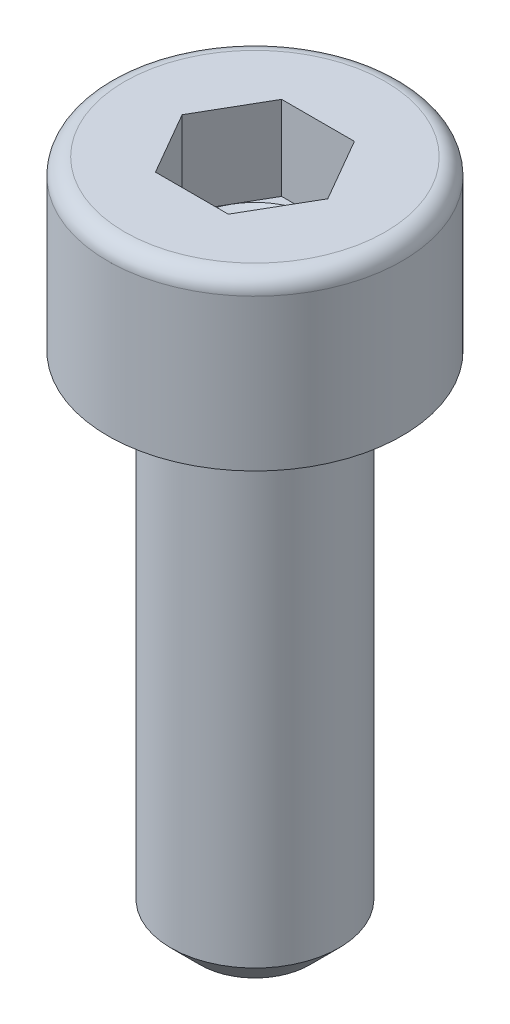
ISO-10303-21;
HEADER;
FILE_DESCRIPTION(('STEP AP214'),'2;1');
FILE_NAME('part.step','',(''),(''),'','','');
FILE_SCHEMA(('AUTOMOTIVE_DESIGN { 1 0 10303 214 1 1 1 1 }'));
ENDSEC;
DATA;
#1=APPLICATION_CONTEXT('core data for automotive mechanical design processes');
#2=APPLICATION_PROTOCOL_DEFINITION('international standard','automotive_design',2000,#1);
#3=PRODUCT_CONTEXT('',#1,'mechanical');
#4=PRODUCT('Part','Part','',(#3));
#5=PRODUCT_RELATED_PRODUCT_CATEGORY('part','',(#4));
#6=PRODUCT_DEFINITION_FORMATION('','',#4);
#7=PRODUCT_DEFINITION_CONTEXT('part definition',#1,'design');
#8=PRODUCT_DEFINITION('design','',#6,#7);
#9=PRODUCT_DEFINITION_SHAPE('','',#8);
#10=(LENGTH_UNIT() NAMED_UNIT(*) SI_UNIT(.MILLI.,.METRE.));
#11=(NAMED_UNIT(*) PLANE_ANGLE_UNIT() SI_UNIT($,.RADIAN.));
#12=(NAMED_UNIT(*) SI_UNIT($,.STERADIAN.) SOLID_ANGLE_UNIT());
#13=UNCERTAINTY_MEASURE_WITH_UNIT(LENGTH_MEASURE(1.E-05),#10,'distance_accuracy_value','');
#14=(GEOMETRIC_REPRESENTATION_CONTEXT(3) GLOBAL_UNCERTAINTY_ASSIGNED_CONTEXT((#13)) GLOBAL_UNIT_ASSIGNED_CONTEXT((#10,
#11,#12)) REPRESENTATION_CONTEXT('',''));
#15=CARTESIAN_POINT('',(0.,0.,0.));
#16=DIRECTION('',(0.,0.,1.));
#17=DIRECTION('',(1.,0.,0.));
#18=AXIS2_PLACEMENT_3D('',#15,#16,#17);
#19=CARTESIAN_POINT('',(-2.59807621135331,2.,1.5));
#20=DIRECTION('',(0.,-1.,0.));
#21=DIRECTION('',(0.,0.,-1.));
#22=AXIS2_PLACEMENT_3D('',#19,#20,#21);
#23=PLANE('',#22);
#24=DIRECTION('',(-0.499999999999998,0.,-0.86602540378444));
#25=VECTOR('',#24,1.);
#26=CARTESIAN_POINT('',(-0.866025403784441,2.,1.5));
#27=LINE('',#26,#25);
#28=CARTESIAN_POINT('',(-1.29903810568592,2.00000000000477,0.750000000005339));
#29=VERTEX_POINT('',#28);
#30=CARTESIAN_POINT('',(-1.73205080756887,2.,0.));
#31=VERTEX_POINT('',#30);
#32=EDGE_CURVE('E116',#29,#31,#27,.T.);
#33=ORIENTED_EDGE('',*,*,#32,.F.);
#34=CARTESIAN_POINT('',(0.,2.00000000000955,0.));
#35=DIRECTION('',(0.,1.,0.));
#36=DIRECTION('',(0.,0.,1.));
#37=AXIS2_PLACEMENT_3D('',#34,#35,#36);
#38=CIRCLE('',#37,1.50000000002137);
#39=CARTESIAN_POINT('',(-1.29903810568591,2.00000000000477,-0.75000000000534));
#40=VERTEX_POINT('',#39);
#41=EDGE_CURVE('E91',#29,#40,#38,.F.);
#42=ORIENTED_EDGE('',*,*,#41,.T.);
#43=DIRECTION('',(0.499999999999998,0.,-0.86602540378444));
#44=VECTOR('',#43,1.);
#45=CARTESIAN_POINT('',(-0.866025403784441,2.,-1.5));
#46=LINE('',#45,#44);
#47=EDGE_CURVE('E117',#31,#40,#46,.T.);
#48=ORIENTED_EDGE('',*,*,#47,.F.);
#49=EDGE_LOOP('',(#33,#42,#48));
#50=FACE_BOUND('',#49,.T.);
#51=ADVANCED_FACE('F16',(#50),#23,.F.);
#52=CARTESIAN_POINT('',(-2.59807621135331,2.,1.5));
#53=DIRECTION('',(0.,-1.,0.));
#54=DIRECTION('',(0.,0.,-1.));
#55=AXIS2_PLACEMENT_3D('',#52,#53,#54);
#56=PLANE('',#55);
#57=DIRECTION('',(-1.,0.,0.));
#58=VECTOR('',#57,1.);
#59=CARTESIAN_POINT('',(0.86602540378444,2.,1.5));
#60=LINE('',#59,#58);
#61=CARTESIAN_POINT('',(0.,2.00000000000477,1.50000000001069));
#62=VERTEX_POINT('',#61);
#63=CARTESIAN_POINT('',(-0.866025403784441,2.,1.5));
#64=VERTEX_POINT('',#63);
#65=EDGE_CURVE('E112',#62,#64,#60,.T.);
#66=ORIENTED_EDGE('',*,*,#65,.F.);
#67=CARTESIAN_POINT('',(0.,2.00000000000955,0.));
#68=DIRECTION('',(0.,1.,0.));
#69=DIRECTION('',(0.,0.,1.));
#70=AXIS2_PLACEMENT_3D('',#67,#68,#69);
#71=CIRCLE('',#70,1.50000000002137);
#72=EDGE_CURVE('E95',#29,#62,#71,.T.);
#73=ORIENTED_EDGE('',*,*,#72,.F.);
#74=DIRECTION('',(-0.499999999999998,0.,-0.86602540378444));
#75=VECTOR('',#74,1.);
#76=CARTESIAN_POINT('',(-0.866025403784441,2.,1.5));
#77=LINE('',#76,#75);
#78=EDGE_CURVE('E109',#64,#29,#77,.T.);
#79=ORIENTED_EDGE('',*,*,#78,.F.);
#80=EDGE_LOOP('',(#66,#73,#79));
#81=FACE_BOUND('',#80,.T.);
#82=ADVANCED_FACE('F107',(#81),#56,.F.);
#83=CARTESIAN_POINT('',(-0.866025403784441,2.,1.5));
#84=DIRECTION('',(0.86602540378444,0.,-0.499999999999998));
#85=DIRECTION('',(-0.499999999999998,0.,-0.86602540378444));
#86=AXIS2_PLACEMENT_3D('',#83,#84,#85);
#87=PLANE('',#86);
#88=ORIENTED_EDGE('',*,*,#32,.T.);
#89=DIRECTION('',(0.,1.,0.));
#90=VECTOR('',#89,1.);
#91=CARTESIAN_POINT('',(-1.73205080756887,2.,0.));
#92=LINE('',#91,#90);
#93=CARTESIAN_POINT('',(-1.73205080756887,4.,0.));
#94=VERTEX_POINT('',#93);
#95=EDGE_CURVE('E136',#94,#31,#92,.F.);
#96=ORIENTED_EDGE('',*,*,#95,.F.);
#97=DIRECTION('',(-0.499999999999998,0.,-0.86602540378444));
#98=VECTOR('',#97,1.);
#99=CARTESIAN_POINT('',(-0.866025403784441,4.,1.5));
#100=LINE('',#99,#98);
#101=CARTESIAN_POINT('',(-0.866025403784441,4.,1.5));
#102=VERTEX_POINT('',#101);
#103=EDGE_CURVE('E114',#94,#102,#100,.F.);
#104=ORIENTED_EDGE('',*,*,#103,.T.);
#105=DIRECTION('',(0.,1.,0.));
#106=VECTOR('',#105,1.);
#107=CARTESIAN_POINT('',(-0.866025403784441,2.,1.5));
#108=LINE('',#107,#106);
#109=EDGE_CURVE('E126',#64,#102,#108,.T.);
#110=ORIENTED_EDGE('',*,*,#109,.F.);
#111=ORIENTED_EDGE('',*,*,#78,.T.);
#112=EDGE_LOOP('',(#88,#96,#104,#110,#111));
#113=FACE_BOUND('',#112,.T.);
#114=ADVANCED_FACE('F123',(#113),#87,.T.);
#115=CARTESIAN_POINT('',(-0.866025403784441,2.,-1.5));
#116=DIRECTION('',(0.86602540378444,0.,0.499999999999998));
#117=DIRECTION('',(0.499999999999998,0.,-0.86602540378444));
#118=AXIS2_PLACEMENT_3D('',#115,#116,#117);
#119=PLANE('',#118);
#120=DIRECTION('',(0.499999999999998,0.,-0.86602540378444));
#121=VECTOR('',#120,1.);
#122=CARTESIAN_POINT('',(-1.29903810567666,2.,-0.749999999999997));
#123=LINE('',#122,#121);
#124=CARTESIAN_POINT('',(-0.866025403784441,2.,-1.5));
#125=VERTEX_POINT('',#124);
#126=EDGE_CURVE('E103',#40,#125,#123,.T.);
#127=ORIENTED_EDGE('',*,*,#126,.T.);
#128=DIRECTION('',(0.,1.,0.));
#129=VECTOR('',#128,1.);
#130=CARTESIAN_POINT('',(-0.866025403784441,2.,-1.5));
#131=LINE('',#130,#129);
#132=CARTESIAN_POINT('',(-0.866025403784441,4.,-1.5));
#133=VERTEX_POINT('',#132);
#134=EDGE_CURVE('E245',#133,#125,#131,.F.);
#135=ORIENTED_EDGE('',*,*,#134,.F.);
#136=DIRECTION('',(0.499999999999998,0.,-0.86602540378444));
#137=VECTOR('',#136,1.);
#138=CARTESIAN_POINT('',(-0.866025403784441,4.,-1.5));
#139=LINE('',#138,#137);
#140=EDGE_CURVE('E121',#133,#94,#139,.F.);
#141=ORIENTED_EDGE('',*,*,#140,.T.);
#142=ORIENTED_EDGE('',*,*,#95,.T.);
#143=ORIENTED_EDGE('',*,*,#47,.T.);
#144=EDGE_LOOP('',(#127,#135,#141,#142,#143));
#145=FACE_BOUND('',#144,.T.);
#146=ADVANCED_FACE('F405',(#145),#119,.T.);
#147=CARTESIAN_POINT('',(-2.59807621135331,2.,1.5));
#148=DIRECTION('',(0.,-1.,0.));
#149=DIRECTION('',(0.,0.,-1.));
#150=AXIS2_PLACEMENT_3D('',#147,#148,#149);
#151=PLANE('',#150);
#152=ORIENTED_EDGE('',*,*,#126,.F.);
#153=CARTESIAN_POINT('',(0.,2.00000000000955,0.));
#154=DIRECTION('',(0.,1.,0.));
#155=DIRECTION('',(0.,0.,1.));
#156=AXIS2_PLACEMENT_3D('',#153,#154,#155);
#157=CIRCLE('',#156,1.50000000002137);
#158=CARTESIAN_POINT('',(0.,2.00000000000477,-1.50000000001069));
#159=VERTEX_POINT('',#158);
#160=EDGE_CURVE('E98',#40,#159,#157,.F.);
#161=ORIENTED_EDGE('',*,*,#160,.T.);
#162=DIRECTION('',(1.,0.,0.));
#163=VECTOR('',#162,1.);
#164=CARTESIAN_POINT('',(0.866025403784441,2.,-1.5));
#165=LINE('',#164,#163);
#166=EDGE_CURVE('E163',#125,#159,#165,.T.);
#167=ORIENTED_EDGE('',*,*,#166,.F.);
#168=EDGE_LOOP('',(#152,#161,#167));
#169=FACE_BOUND('',#168,.T.);
#170=ADVANCED_FACE('F397',(#169),#151,.F.);
#171=CARTESIAN_POINT('',(0.,2.00000000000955,0.));
#172=DIRECTION('',(0.,1.,0.));
#173=DIRECTION('',(0.,0.,1.));
#174=AXIS2_PLACEMENT_3D('',#171,#172,#173);
#175=CONICAL_SURFACE('',#174,1.50000000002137,1.0471975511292);
#176=CARTESIAN_POINT('',(-4.2632564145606E-11,1.13397459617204,0.));
#177=VERTEX_POINT('',#176);
#178=VERTEX_LOOP('',#177);
#179=FACE_BOUND('',#178,.T.);
#180=CARTESIAN_POINT('',(0.,2.00000000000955,0.));
#181=DIRECTION('',(0.,1.,0.));
#182=DIRECTION('',(0.,0.,1.));
#183=AXIS2_PLACEMENT_3D('',#180,#181,#182);
#184=CIRCLE('',#183,1.50000000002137);
#185=CARTESIAN_POINT('',(1.29903810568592,2.00000000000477,0.750000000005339));
#186=VERTEX_POINT('',#185);
#187=EDGE_CURVE('E150',#62,#186,#184,.T.);
#188=ORIENTED_EDGE('',*,*,#187,.T.);
#189=CARTESIAN_POINT('',(0.,2.00000000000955,0.));
#190=DIRECTION('',(0.,1.,0.));
#191=DIRECTION('',(0.,0.,1.));
#192=AXIS2_PLACEMENT_3D('',#189,#190,#191);
#193=CIRCLE('',#192,1.50000000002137);
#194=CARTESIAN_POINT('',(1.29903810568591,2.00000000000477,-0.75000000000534));
#195=VERTEX_POINT('',#194);
#196=EDGE_CURVE('E165',#195,#186,#193,.F.);
#197=ORIENTED_EDGE('',*,*,#196,.F.);
#198=CARTESIAN_POINT('',(0.,2.00000000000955,0.));
#199=DIRECTION('',(0.,1.,0.));
#200=DIRECTION('',(0.,0.,1.));
#201=AXIS2_PLACEMENT_3D('',#198,#199,#200);
#202=CIRCLE('',#201,1.50000000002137);
#203=EDGE_CURVE('E160',#195,#159,#202,.T.);
#204=ORIENTED_EDGE('',*,*,#203,.T.);
#205=ORIENTED_EDGE('',*,*,#160,.F.);
#206=ORIENTED_EDGE('',*,*,#41,.F.);
#207=ORIENTED_EDGE('',*,*,#72,.T.);
#208=EDGE_LOOP('',(#188,#197,#204,#205,#206,#207));
#209=FACE_BOUND('',#208,.T.);
#210=ADVANCED_FACE('F94',(#179,#209),#175,.F.);
#211=CARTESIAN_POINT('',(-2.59807621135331,2.,1.5));
#212=DIRECTION('',(0.,-1.,0.));
#213=DIRECTION('',(0.,0.,-1.));
#214=AXIS2_PLACEMENT_3D('',#211,#212,#213);
#215=PLANE('',#214);
#216=DIRECTION('',(-0.499999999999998,0.,0.86602540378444));
#217=VECTOR('',#216,1.);
#218=CARTESIAN_POINT('',(0.86602540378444,2.,1.5));
#219=LINE('',#218,#217);
#220=CARTESIAN_POINT('',(0.866025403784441,2.,1.5));
#221=VERTEX_POINT('',#220);
#222=EDGE_CURVE('E233',#186,#221,#219,.T.);
#223=ORIENTED_EDGE('',*,*,#222,.F.);
#224=ORIENTED_EDGE('',*,*,#187,.F.);
#225=DIRECTION('',(-1.,0.,0.));
#226=VECTOR('',#225,1.);
#227=CARTESIAN_POINT('',(0.86602540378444,2.,1.5));
#228=LINE('',#227,#226);
#229=EDGE_CURVE('E149',#221,#62,#228,.T.);
#230=ORIENTED_EDGE('',*,*,#229,.F.);
#231=EDGE_LOOP('',(#223,#224,#230));
#232=FACE_BOUND('',#231,.T.);
#233=ADVANCED_FACE('F282',(#232),#215,.F.);
#234=CARTESIAN_POINT('',(0.86602540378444,2.,1.5));
#235=DIRECTION('',(0.,0.,-1.));
#236=DIRECTION('',(-1.,0.,0.));
#237=AXIS2_PLACEMENT_3D('',#234,#235,#236);
#238=PLANE('',#237);
#239=ORIENTED_EDGE('',*,*,#65,.T.);
#240=ORIENTED_EDGE('',*,*,#109,.T.);
#241=DIRECTION('',(-1.,0.,0.));
#242=VECTOR('',#241,1.);
#243=CARTESIAN_POINT('',(0.86602540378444,4.,1.5));
#244=LINE('',#243,#242);
#245=CARTESIAN_POINT('',(0.86602540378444,4.,1.5));
#246=VERTEX_POINT('',#245);
#247=EDGE_CURVE('E146',#102,#246,#244,.F.);
#248=ORIENTED_EDGE('',*,*,#247,.T.);
#249=DIRECTION('',(0.,1.,0.));
#250=VECTOR('',#249,1.);
#251=CARTESIAN_POINT('',(0.86602540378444,2.,1.5));
#252=LINE('',#251,#250);
#253=EDGE_CURVE('E239',#221,#246,#252,.T.);
#254=ORIENTED_EDGE('',*,*,#253,.F.);
#255=ORIENTED_EDGE('',*,*,#229,.T.);
#256=EDGE_LOOP('',(#239,#240,#248,#254,#255));
#257=FACE_BOUND('',#256,.T.);
#258=ADVANCED_FACE('F278',(#257),#238,.T.);
#259=CARTESIAN_POINT('',(0.866025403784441,2.,-1.5));
#260=DIRECTION('',(0.,0.,1.));
#261=DIRECTION('',(1.,0.,0.));
#262=AXIS2_PLACEMENT_3D('',#259,#260,#261);
#263=PLANE('',#262);
#264=DIRECTION('',(1.,0.,0.));
#265=VECTOR('',#264,1.);
#266=CARTESIAN_POINT('',(-2.59807621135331,2.,-1.5));
#267=LINE('',#266,#265);
#268=CARTESIAN_POINT('',(0.86602540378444,2.,-1.5));
#269=VERTEX_POINT('',#268);
#270=EDGE_CURVE('E162',#159,#269,#267,.T.);
#271=ORIENTED_EDGE('',*,*,#270,.T.);
#272=DIRECTION('',(0.,1.,0.));
#273=VECTOR('',#272,1.);
#274=CARTESIAN_POINT('',(0.866025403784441,2.,-1.5));
#275=LINE('',#274,#273);
#276=CARTESIAN_POINT('',(0.86602540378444,4.,-1.5));
#277=VERTEX_POINT('',#276);
#278=EDGE_CURVE('E218',#277,#269,#275,.F.);
#279=ORIENTED_EDGE('',*,*,#278,.F.);
#280=DIRECTION('',(1.,0.,0.));
#281=VECTOR('',#280,1.);
#282=CARTESIAN_POINT('',(0.866025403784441,4.,-1.5));
#283=LINE('',#282,#281);
#284=EDGE_CURVE('E242',#277,#133,#283,.F.);
#285=ORIENTED_EDGE('',*,*,#284,.T.);
#286=ORIENTED_EDGE('',*,*,#134,.T.);
#287=ORIENTED_EDGE('',*,*,#166,.T.);
#288=EDGE_LOOP('',(#271,#279,#285,#286,#287));
#289=FACE_BOUND('',#288,.T.);
#290=ADVANCED_FACE('F299',(#289),#263,.T.);
#291=CARTESIAN_POINT('',(-2.59807621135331,2.,1.5));
#292=DIRECTION('',(0.,-1.,0.));
#293=DIRECTION('',(0.,0.,-1.));
#294=AXIS2_PLACEMENT_3D('',#291,#292,#293);
#295=PLANE('',#294);
#296=ORIENTED_EDGE('',*,*,#270,.F.);
#297=ORIENTED_EDGE('',*,*,#203,.F.);
#298=DIRECTION('',(0.499999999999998,0.,0.86602540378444));
#299=VECTOR('',#298,1.);
#300=CARTESIAN_POINT('',(0.866025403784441,2.,-1.5));
#301=LINE('',#300,#299);
#302=EDGE_CURVE('E209',#269,#195,#301,.T.);
#303=ORIENTED_EDGE('',*,*,#302,.F.);
#304=EDGE_LOOP('',(#296,#297,#303));
#305=FACE_BOUND('',#304,.T.);
#306=ADVANCED_FACE('F303',(#305),#295,.F.);
#307=CARTESIAN_POINT('',(-2.59807621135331,2.,1.5));
#308=DIRECTION('',(0.,-1.,0.));
#309=DIRECTION('',(0.,0.,-1.));
#310=AXIS2_PLACEMENT_3D('',#307,#308,#309);
#311=PLANE('',#310);
#312=DIRECTION('',(0.499999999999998,0.,0.86602540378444));
#313=VECTOR('',#312,1.);
#314=CARTESIAN_POINT('',(0.866025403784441,2.,-1.5));
#315=LINE('',#314,#313);
#316=CARTESIAN_POINT('',(1.73205080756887,2.,0.));
#317=VERTEX_POINT('',#316);
#318=EDGE_CURVE('E217',#195,#317,#315,.T.);
#319=ORIENTED_EDGE('',*,*,#318,.F.);
#320=ORIENTED_EDGE('',*,*,#196,.T.);
#321=DIRECTION('',(-0.499999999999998,0.,0.86602540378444));
#322=VECTOR('',#321,1.);
#323=CARTESIAN_POINT('',(0.86602540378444,2.,1.5));
#324=LINE('',#323,#322);
#325=EDGE_CURVE('E230',#317,#186,#324,.T.);
#326=ORIENTED_EDGE('',*,*,#325,.F.);
#327=EDGE_LOOP('',(#319,#320,#326));
#328=FACE_BOUND('',#327,.T.);
#329=ADVANCED_FACE('F304',(#328),#311,.F.);
#330=CARTESIAN_POINT('',(0.86602540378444,2.,1.5));
#331=DIRECTION('',(-0.86602540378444,0.,-0.499999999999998));
#332=DIRECTION('',(-0.499999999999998,0.,0.86602540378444));
#333=AXIS2_PLACEMENT_3D('',#330,#331,#332);
#334=PLANE('',#333);
#335=ORIENTED_EDGE('',*,*,#222,.T.);
#336=ORIENTED_EDGE('',*,*,#253,.T.);
#337=DIRECTION('',(-0.499999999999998,0.,0.86602540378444));
#338=VECTOR('',#337,1.);
#339=CARTESIAN_POINT('',(0.86602540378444,4.,1.5));
#340=LINE('',#339,#338);
#341=CARTESIAN_POINT('',(1.73205080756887,4.,0.));
#342=VERTEX_POINT('',#341);
#343=EDGE_CURVE('E234',#246,#342,#340,.F.);
#344=ORIENTED_EDGE('',*,*,#343,.T.);
#345=DIRECTION('',(0.,1.,0.));
#346=VECTOR('',#345,1.);
#347=CARTESIAN_POINT('',(1.73205080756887,2.,0.));
#348=LINE('',#347,#346);
#349=EDGE_CURVE('E223',#317,#342,#348,.T.);
#350=ORIENTED_EDGE('',*,*,#349,.F.);
#351=ORIENTED_EDGE('',*,*,#325,.T.);
#352=EDGE_LOOP('',(#335,#336,#344,#350,#351));
#353=FACE_BOUND('',#352,.T.);
#354=ADVANCED_FACE('F293',(#353),#334,.T.);
#355=CARTESIAN_POINT('',(0.866025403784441,2.,-1.5));
#356=DIRECTION('',(-0.86602540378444,0.,0.499999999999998));
#357=DIRECTION('',(0.499999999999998,0.,0.86602540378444));
#358=AXIS2_PLACEMENT_3D('',#355,#356,#357);
#359=PLANE('',#358);
#360=ORIENTED_EDGE('',*,*,#318,.T.);
#361=ORIENTED_EDGE('',*,*,#349,.T.);
#362=DIRECTION('',(-0.499999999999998,0.,-0.86602540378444));
#363=VECTOR('',#362,1.);
#364=CARTESIAN_POINT('',(1.73205080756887,4.,0.));
#365=LINE('',#364,#363);
#366=EDGE_CURVE('E173',#342,#277,#365,.T.);
#367=ORIENTED_EDGE('',*,*,#366,.T.);
#368=ORIENTED_EDGE('',*,*,#278,.T.);
#369=ORIENTED_EDGE('',*,*,#302,.T.);
#370=EDGE_LOOP('',(#360,#361,#367,#368,#369));
#371=FACE_BOUND('',#370,.T.);
#372=ADVANCED_FACE('F194',(#371),#359,.T.);
#373=CARTESIAN_POINT('',(1.5,4.,0.));
#374=DIRECTION('',(0.,-1.,0.));
#375=DIRECTION('',(1.,0.,0.));
#376=AXIS2_PLACEMENT_3D('',#373,#374,#375);
#377=PLANE('',#376);
#378=ORIENTED_EDGE('',*,*,#343,.F.);
#379=ORIENTED_EDGE('',*,*,#247,.F.);
#380=ORIENTED_EDGE('',*,*,#103,.F.);
#381=ORIENTED_EDGE('',*,*,#140,.F.);
#382=ORIENTED_EDGE('',*,*,#284,.F.);
#383=ORIENTED_EDGE('',*,*,#366,.F.);
#384=EDGE_LOOP('',(#378,#379,#380,#381,#382,#383));
#385=FACE_BOUND('',#384,.T.);
#386=CARTESIAN_POINT('',(0.,4.,0.));
#387=DIRECTION('',(0.,-1.,0.));
#388=DIRECTION('',(-1.,0.,0.));
#389=AXIS2_PLACEMENT_3D('',#386,#387,#388);
#390=CIRCLE('',#389,3.1);
#391=CARTESIAN_POINT('',(-3.1,4.,0.));
#392=VERTEX_POINT('',#391);
#393=CARTESIAN_POINT('',(3.1,4.,0.));
#394=VERTEX_POINT('',#393);
#395=EDGE_CURVE('E36',#392,#394,#390,.T.);
#396=ORIENTED_EDGE('',*,*,#395,.F.);
#397=CARTESIAN_POINT('',(0.,4.,0.));
#398=DIRECTION('',(0.,-1.,0.));
#399=DIRECTION('',(1.,0.,0.));
#400=AXIS2_PLACEMENT_3D('',#397,#398,#399);
#401=CIRCLE('',#400,3.1);
#402=EDGE_CURVE('E171',#394,#392,#401,.T.);
#403=ORIENTED_EDGE('',*,*,#402,.F.);
#404=EDGE_LOOP('',(#396,#403));
#405=FACE_BOUND('',#404,.T.);
#406=ADVANCED_FACE('F175',(#385,#405),#377,.F.);
#407=CARTESIAN_POINT('',(0.,3.6,0.));
#408=DIRECTION('',(0.,1.,0.));
#409=DIRECTION('',(-1.,0.,0.));
#410=AXIS2_PLACEMENT_3D('',#407,#408,#409);
#411=TOROIDAL_SURFACE('',#410,3.1,0.4);
#412=ORIENTED_EDGE('',*,*,#395,.T.);
#413=ORIENTED_EDGE('',*,*,#402,.T.);
#414=EDGE_LOOP('',(#412,#413));
#415=FACE_BOUND('',#414,.T.);
#416=CARTESIAN_POINT('',(0.,3.6,0.));
#417=DIRECTION('',(0.,1.,0.));
#418=DIRECTION('',(-1.,0.,0.));
#419=AXIS2_PLACEMENT_3D('',#416,#417,#418);
#420=CIRCLE('',#419,3.5);
#421=CARTESIAN_POINT('',(-3.5,3.6,0.));
#422=VERTEX_POINT('',#421);
#423=EDGE_CURVE('E159',#422,#422,#420,.F.);
#424=ORIENTED_EDGE('',*,*,#423,.F.);
#425=EDGE_LOOP('',(#424));
#426=FACE_BOUND('',#425,.T.);
#427=ADVANCED_FACE('F169',(#415,#426),#411,.T.);
#428=CARTESIAN_POINT('',(0.,-12.,0.));
#429=DIRECTION('',(0.,1.,0.));
#430=DIRECTION('',(0.,0.,1.));
#431=AXIS2_PLACEMENT_3D('',#428,#429,#430);
#432=PLANE('',#431);
#433=CARTESIAN_POINT('',(0.,-11.9999999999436,0.));
#434=DIRECTION('',(0.,1.,0.));
#435=DIRECTION('',(0.,0.,1.));
#436=AXIS2_PLACEMENT_3D('',#433,#434,#435);
#437=CIRCLE('',#436,1.30000000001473);
#438=CARTESIAN_POINT('',(0.,-11.9999999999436,1.30000000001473));
#439=VERTEX_POINT('',#438);
#440=EDGE_CURVE('E156',#439,#439,#437,.T.);
#441=ORIENTED_EDGE('',*,*,#440,.F.);
#442=EDGE_LOOP('',(#441));
#443=FACE_BOUND('',#442,.T.);
#444=ADVANCED_FACE('F201',(#443),#432,.F.);
#445=CARTESIAN_POINT('',(0.,4.,0.));
#446=DIRECTION('',(0.,1.,0.));
#447=DIRECTION('',(-1.,0.,0.));
#448=AXIS2_PLACEMENT_3D('',#445,#446,#447);
#449=CYLINDRICAL_SURFACE('',#448,3.5);
#450=ORIENTED_EDGE('',*,*,#423,.T.);
#451=EDGE_LOOP('',(#450));
#452=FACE_BOUND('',#451,.T.);
#453=CARTESIAN_POINT('',(0.,0.,0.));
#454=DIRECTION('',(0.,1.,0.));
#455=DIRECTION('',(-1.,0.,0.));
#456=AXIS2_PLACEMENT_3D('',#453,#454,#455);
#457=CIRCLE('',#456,3.5);
#458=CARTESIAN_POINT('',(-3.5,0.,0.));
#459=VERTEX_POINT('',#458);
#460=EDGE_CURVE('E153',#459,#459,#457,.T.);
#461=ORIENTED_EDGE('',*,*,#460,.T.);
#462=EDGE_LOOP('',(#461));
#463=FACE_BOUND('',#462,.T.);
#464=ADVANCED_FACE('F330',(#452,#463),#449,.T.);
#465=CARTESIAN_POINT('',(0.,-11.3000000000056,0.));
#466=DIRECTION('',(0.,1.,0.));
#467=DIRECTION('',(0.,0.,1.));
#468=AXIS2_PLACEMENT_3D('',#465,#466,#467);
#469=CONICAL_SURFACE('',#468,1.99999999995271,0.785398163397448);
#470=ORIENTED_EDGE('',*,*,#440,.T.);
#471=EDGE_LOOP('',(#470));
#472=FACE_BOUND('',#471,.T.);
#473=CARTESIAN_POINT('',(0.,-11.3,0.));
#474=DIRECTION('',(0.,1.,0.));
#475=DIRECTION('',(0.,0.,1.));
#476=AXIS2_PLACEMENT_3D('',#473,#474,#475);
#477=CIRCLE('',#476,2.);
#478=CARTESIAN_POINT('',(0.,-11.3,2.));
#479=VERTEX_POINT('',#478);
#480=EDGE_CURVE('E28',#479,#479,#477,.T.);
#481=ORIENTED_EDGE('',*,*,#480,.F.);
#482=EDGE_LOOP('',(#481));
#483=FACE_BOUND('',#482,.T.);
#484=ADVANCED_FACE('F319',(#472,#483),#469,.T.);
#485=CARTESIAN_POINT('',(0.,0.,0.));
#486=DIRECTION('',(0.,1.,0.));
#487=DIRECTION('',(-1.,0.,0.));
#488=AXIS2_PLACEMENT_3D('',#485,#486,#487);
#489=PLANE('',#488);
#490=ORIENTED_EDGE('',*,*,#460,.F.);
#491=EDGE_LOOP('',(#490));
#492=FACE_BOUND('',#491,.T.);
#493=CARTESIAN_POINT('',(0.,0.,0.));
#494=DIRECTION('',(0.,1.,0.));
#495=DIRECTION('',(0.,0.,1.));
#496=AXIS2_PLACEMENT_3D('',#493,#494,#495);
#497=CIRCLE('',#496,2.);
#498=CARTESIAN_POINT('',(0.,0.,2.));
#499=VERTEX_POINT('',#498);
#500=EDGE_CURVE('E10',#499,#499,#497,.F.);
#501=ORIENTED_EDGE('',*,*,#500,.F.);
#502=EDGE_LOOP('',(#501));
#503=FACE_BOUND('',#502,.T.);
#504=ADVANCED_FACE('F314',(#492,#503),#489,.F.);
#505=CARTESIAN_POINT('',(0.,-12.,0.));
#506=DIRECTION('',(0.,1.,0.));
#507=DIRECTION('',(0.,0.,1.));
#508=AXIS2_PLACEMENT_3D('',#505,#506,#507);
#509=CYLINDRICAL_SURFACE('',#508,2.);
#510=ORIENTED_EDGE('',*,*,#480,.T.);
#511=EDGE_LOOP('',(#510));
#512=FACE_BOUND('',#511,.T.);
#513=ORIENTED_EDGE('',*,*,#500,.T.);
#514=EDGE_LOOP('',(#513));
#515=FACE_BOUND('',#514,.T.);
#516=ADVANCED_FACE('F18',(#512,#515),#509,.T.);
#517=CLOSED_SHELL('',(#51,#82,#114,#146,#170,#210,#233,#258,#290,#306,#329,#354,#372,#406,#427,
#444,#464,#484,#504,#516));
#518=MANIFOLD_SOLID_BREP('B1',#517);
#519=ADVANCED_BREP_SHAPE_REPRESENTATION('',(#18,#518),#14);
#520=SHAPE_DEFINITION_REPRESENTATION(#9,#519);
ENDSEC;
END-ISO-10303-21;
